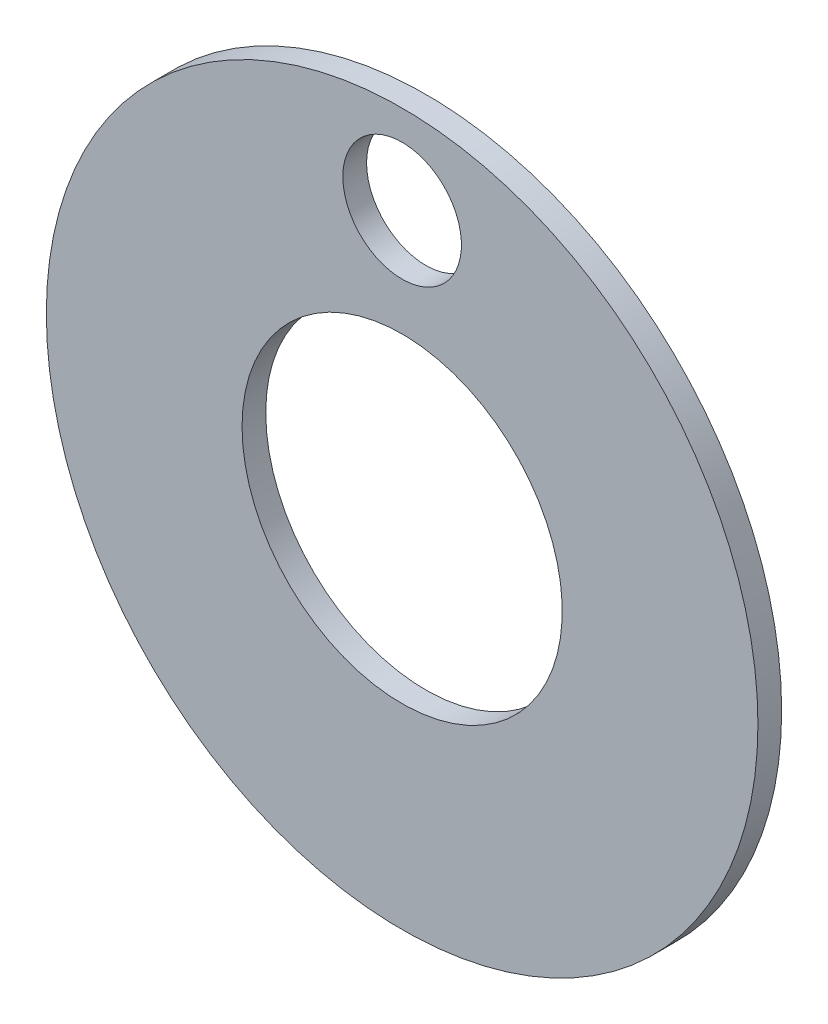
ISO-10303-21;
HEADER;
FILE_DESCRIPTION(('STEP AP214'),'2;1');
FILE_NAME('part.step','',(''),(''),'','','');
FILE_SCHEMA(('AUTOMOTIVE_DESIGN { 1 0 10303 214 1 1 1 1 }'));
ENDSEC;
DATA;
#1=APPLICATION_CONTEXT('core data for automotive mechanical design processes');
#2=APPLICATION_PROTOCOL_DEFINITION('international standard','automotive_design',2000,#1);
#3=PRODUCT_CONTEXT('',#1,'mechanical');
#4=PRODUCT('Part','Part','',(#3));
#5=PRODUCT_RELATED_PRODUCT_CATEGORY('part','',(#4));
#6=PRODUCT_DEFINITION_FORMATION('','',#4);
#7=PRODUCT_DEFINITION_CONTEXT('part definition',#1,'design');
#8=PRODUCT_DEFINITION('design','',#6,#7);
#9=PRODUCT_DEFINITION_SHAPE('','',#8);
#10=(LENGTH_UNIT() NAMED_UNIT(*) SI_UNIT(.MILLI.,.METRE.));
#11=(NAMED_UNIT(*) PLANE_ANGLE_UNIT() SI_UNIT($,.RADIAN.));
#12=(NAMED_UNIT(*) SI_UNIT($,.STERADIAN.) SOLID_ANGLE_UNIT());
#13=UNCERTAINTY_MEASURE_WITH_UNIT(LENGTH_MEASURE(1.E-05),#10,'distance_accuracy_value','');
#14=(GEOMETRIC_REPRESENTATION_CONTEXT(3) GLOBAL_UNCERTAINTY_ASSIGNED_CONTEXT((#13)) GLOBAL_UNIT_ASSIGNED_CONTEXT((#10,
#11,#12)) REPRESENTATION_CONTEXT('',''));
#15=CARTESIAN_POINT('',(0.,0.,0.));
#16=DIRECTION('',(0.,0.,1.));
#17=DIRECTION('',(1.,0.,0.));
#18=AXIS2_PLACEMENT_3D('',#15,#16,#17);
#19=CARTESIAN_POINT('',(0.,0.,-0.5));
#20=DIRECTION('',(0.,0.,1.));
#21=DIRECTION('',(1.,0.,0.));
#22=AXIS2_PLACEMENT_3D('',#19,#20,#21);
#23=CYLINDRICAL_SURFACE('',#22,15.);
#24=CARTESIAN_POINT('',(0.,0.,-0.5));
#25=DIRECTION('',(0.,0.,1.));
#26=DIRECTION('',(-1.,0.,0.));
#27=AXIS2_PLACEMENT_3D('',#24,#25,#26);
#28=CIRCLE('',#27,15.);
#29=CARTESIAN_POINT('',(-15.,0.,-0.5));
#30=VERTEX_POINT('',#29);
#31=EDGE_CURVE('E10',#30,#30,#28,.T.);
#32=ORIENTED_EDGE('',*,*,#31,.T.);
#33=EDGE_LOOP('',(#32));
#34=FACE_BOUND('',#33,.T.);
#35=CARTESIAN_POINT('',(0.,0.,0.499999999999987));
#36=DIRECTION('',(0.,0.,1.));
#37=DIRECTION('',(-1.,0.,0.));
#38=AXIS2_PLACEMENT_3D('',#35,#36,#37);
#39=CIRCLE('',#38,15.);
#40=CARTESIAN_POINT('',(-15.,0.,0.499999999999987));
#41=VERTEX_POINT('',#40);
#42=EDGE_CURVE('E36',#41,#41,#39,.T.);
#43=ORIENTED_EDGE('',*,*,#42,.F.);
#44=EDGE_LOOP('',(#43));
#45=FACE_BOUND('',#44,.T.);
#46=ADVANCED_FACE('F33',(#34,#45),#23,.T.);
#47=CARTESIAN_POINT('',(0.,0.,-0.5));
#48=DIRECTION('',(0.,0.,-1.));
#49=DIRECTION('',(-1.,0.,0.));
#50=AXIS2_PLACEMENT_3D('',#47,#48,#49);
#51=PLANE('',#50);
#52=CARTESIAN_POINT('',(0.,11.25,-0.5));
#53=DIRECTION('',(0.,0.,1.));
#54=DIRECTION('',(-1.,0.,0.));
#55=AXIS2_PLACEMENT_3D('',#52,#53,#54);
#56=CIRCLE('',#55,2.5);
#57=CARTESIAN_POINT('',(-2.50000000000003,11.25,-0.5));
#58=VERTEX_POINT('',#57);
#59=EDGE_CURVE('E48',#58,#58,#56,.T.);
#60=ORIENTED_EDGE('',*,*,#59,.T.);
#61=EDGE_LOOP('',(#60));
#62=FACE_BOUND('',#61,.T.);
#63=CARTESIAN_POINT('',(0.,0.,-0.5));
#64=DIRECTION('',(0.,0.,1.));
#65=DIRECTION('',(-1.,0.,0.));
#66=AXIS2_PLACEMENT_3D('',#63,#64,#65);
#67=CIRCLE('',#66,6.75);
#68=CARTESIAN_POINT('',(-6.75,0.,-0.5));
#69=VERTEX_POINT('',#68);
#70=EDGE_CURVE('E43',#69,#69,#67,.T.);
#71=ORIENTED_EDGE('',*,*,#70,.T.);
#72=EDGE_LOOP('',(#71));
#73=FACE_BOUND('',#72,.T.);
#74=ORIENTED_EDGE('',*,*,#31,.F.);
#75=EDGE_LOOP('',(#74));
#76=FACE_BOUND('',#75,.T.);
#77=ADVANCED_FACE('F57',(#62,#73,#76),#51,.T.);
#78=CARTESIAN_POINT('',(0.,0.,0.499999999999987));
#79=DIRECTION('',(0.,0.,-1.));
#80=DIRECTION('',(-1.,0.,0.));
#81=AXIS2_PLACEMENT_3D('',#78,#79,#80);
#82=PLANE('',#81);
#83=CARTESIAN_POINT('',(0.,11.25,0.499999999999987));
#84=DIRECTION('',(0.,0.,1.));
#85=DIRECTION('',(-1.,0.,0.));
#86=AXIS2_PLACEMENT_3D('',#83,#84,#85);
#87=CIRCLE('',#86,2.5);
#88=CARTESIAN_POINT('',(-2.50000000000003,11.25,0.499999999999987));
#89=VERTEX_POINT('',#88);
#90=EDGE_CURVE('E51',#89,#89,#87,.T.);
#91=ORIENTED_EDGE('',*,*,#90,.F.);
#92=EDGE_LOOP('',(#91));
#93=FACE_BOUND('',#92,.T.);
#94=CARTESIAN_POINT('',(0.,0.,0.499999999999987));
#95=DIRECTION('',(0.,0.,1.));
#96=DIRECTION('',(-1.,0.,0.));
#97=AXIS2_PLACEMENT_3D('',#94,#95,#96);
#98=CIRCLE('',#97,6.75);
#99=CARTESIAN_POINT('',(-6.75,0.,0.499999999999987));
#100=VERTEX_POINT('',#99);
#101=EDGE_CURVE('E45',#100,#100,#98,.T.);
#102=ORIENTED_EDGE('',*,*,#101,.F.);
#103=EDGE_LOOP('',(#102));
#104=FACE_BOUND('',#103,.T.);
#105=ORIENTED_EDGE('',*,*,#42,.T.);
#106=EDGE_LOOP('',(#105));
#107=FACE_BOUND('',#106,.T.);
#108=ADVANCED_FACE('F67',(#93,#104,#107),#82,.F.);
#109=CARTESIAN_POINT('',(0.,0.,-0.5));
#110=DIRECTION('',(0.,0.,1.));
#111=DIRECTION('',(1.,0.,0.));
#112=AXIS2_PLACEMENT_3D('',#109,#110,#111);
#113=CYLINDRICAL_SURFACE('',#112,6.75);
#114=ORIENTED_EDGE('',*,*,#70,.F.);
#115=EDGE_LOOP('',(#114));
#116=FACE_BOUND('',#115,.T.);
#117=ORIENTED_EDGE('',*,*,#101,.T.);
#118=EDGE_LOOP('',(#117));
#119=FACE_BOUND('',#118,.T.);
#120=ADVANCED_FACE('F63',(#116,#119),#113,.F.);
#121=CARTESIAN_POINT('',(0.,11.25,-0.5));
#122=DIRECTION('',(0.,0.,1.));
#123=DIRECTION('',(1.,0.,0.));
#124=AXIS2_PLACEMENT_3D('',#121,#122,#123);
#125=CYLINDRICAL_SURFACE('',#124,2.5);
#126=ORIENTED_EDGE('',*,*,#59,.F.);
#127=EDGE_LOOP('',(#126));
#128=FACE_BOUND('',#127,.T.);
#129=ORIENTED_EDGE('',*,*,#90,.T.);
#130=EDGE_LOOP('',(#129));
#131=FACE_BOUND('',#130,.T.);
#132=ADVANCED_FACE('F60',(#128,#131),#125,.F.);
#133=CLOSED_SHELL('',(#46,#77,#108,#120,#132));
#134=MANIFOLD_SOLID_BREP('B2',#133);
#135=ADVANCED_BREP_SHAPE_REPRESENTATION('',(#18,#134),#14);
#136=SHAPE_DEFINITION_REPRESENTATION(#9,#135);
ENDSEC;
END-ISO-10303-21;
